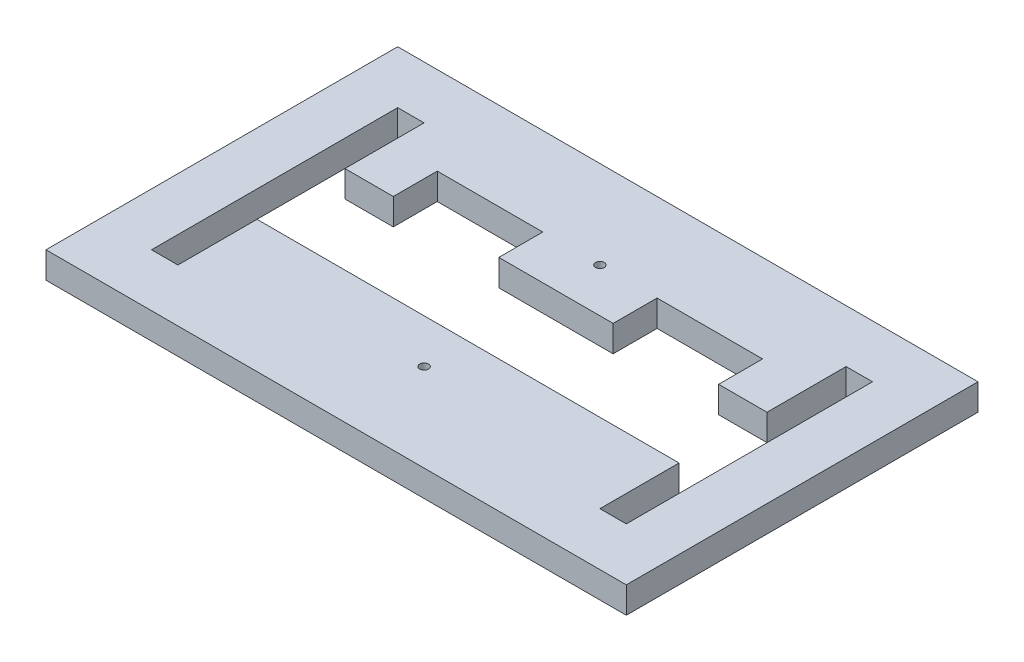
ISO-10303-21;
HEADER;
FILE_DESCRIPTION(('STEP AP214'),'2;1');
FILE_NAME('part.step','',(''),(''),'','','');
FILE_SCHEMA(('AUTOMOTIVE_DESIGN { 1 0 10303 214 1 1 1 1 }'));
ENDSEC;
DATA;
#1=APPLICATION_CONTEXT('core data for automotive mechanical design processes');
#2=APPLICATION_PROTOCOL_DEFINITION('international standard','automotive_design',2000,#1);
#3=PRODUCT_CONTEXT('',#1,'mechanical');
#4=PRODUCT('Part','Part','',(#3));
#5=PRODUCT_RELATED_PRODUCT_CATEGORY('part','',(#4));
#6=PRODUCT_DEFINITION_FORMATION('','',#4);
#7=PRODUCT_DEFINITION_CONTEXT('part definition',#1,'design');
#8=PRODUCT_DEFINITION('design','',#6,#7);
#9=PRODUCT_DEFINITION_SHAPE('','',#8);
#10=(LENGTH_UNIT() NAMED_UNIT(*) SI_UNIT(.MILLI.,.METRE.));
#11=(NAMED_UNIT(*) PLANE_ANGLE_UNIT() SI_UNIT($,.RADIAN.));
#12=(NAMED_UNIT(*) SI_UNIT($,.STERADIAN.) SOLID_ANGLE_UNIT());
#13=UNCERTAINTY_MEASURE_WITH_UNIT(LENGTH_MEASURE(1.E-05),#10,'distance_accuracy_value','');
#14=(GEOMETRIC_REPRESENTATION_CONTEXT(3) GLOBAL_UNCERTAINTY_ASSIGNED_CONTEXT((#13)) GLOBAL_UNIT_ASSIGNED_CONTEXT((#10,
#11,#12)) REPRESENTATION_CONTEXT('',''));
#15=CARTESIAN_POINT('',(0.,0.,0.));
#16=DIRECTION('',(0.,0.,1.));
#17=DIRECTION('',(1.,0.,0.));
#18=AXIS2_PLACEMENT_3D('',#15,#16,#17);
#19=CARTESIAN_POINT('',(33.,3.,20.));
#20=DIRECTION('',(0.,1.,0.));
#21=DIRECTION('',(0.,0.,1.));
#22=AXIS2_PLACEMENT_3D('',#19,#20,#21);
#23=PLANE('',#22);
#24=CARTESIAN_POINT('',(0.,3.,-10.));
#25=DIRECTION('',(0.,1.,0.));
#26=DIRECTION('',(0.,0.,1.));
#27=AXIS2_PLACEMENT_3D('',#24,#25,#26);
#28=CIRCLE('',#27,0.5);
#29=CARTESIAN_POINT('',(0.,3.,-9.5));
#30=VERTEX_POINT('',#29);
#31=EDGE_CURVE('E223',#30,#30,#28,.F.);
#32=ORIENTED_EDGE('',*,*,#31,.T.);
#33=EDGE_LOOP('',(#32));
#34=FACE_BOUND('',#33,.T.);
#35=DIRECTION('',(0.,0.,-1.));
#36=VECTOR('',#35,1.);
#37=CARTESIAN_POINT('',(33.,3.,-20.));
#38=LINE('',#37,#36);
#39=CARTESIAN_POINT('',(33.,3.,20.));
#40=VERTEX_POINT('',#39);
#41=CARTESIAN_POINT('',(33.,3.,-20.));
#42=VERTEX_POINT('',#41);
#43=EDGE_CURVE('E305',#40,#42,#38,.T.);
#44=ORIENTED_EDGE('',*,*,#43,.T.);
#45=DIRECTION('',(-1.,0.,0.));
#46=VECTOR('',#45,1.);
#47=CARTESIAN_POINT('',(-33.,3.,-20.));
#48=LINE('',#47,#46);
#49=CARTESIAN_POINT('',(-33.,3.,-20.));
#50=VERTEX_POINT('',#49);
#51=EDGE_CURVE('E317',#42,#50,#48,.T.);
#52=ORIENTED_EDGE('',*,*,#51,.T.);
#53=DIRECTION('',(0.,0.,1.));
#54=VECTOR('',#53,1.);
#55=CARTESIAN_POINT('',(-33.,3.,-20.));
#56=LINE('',#55,#54);
#57=CARTESIAN_POINT('',(-33.,3.,20.));
#58=VERTEX_POINT('',#57);
#59=EDGE_CURVE('E315',#50,#58,#56,.T.);
#60=ORIENTED_EDGE('',*,*,#59,.T.);
#61=DIRECTION('',(1.,0.,0.));
#62=VECTOR('',#61,1.);
#63=CARTESIAN_POINT('',(-33.,3.,20.));
#64=LINE('',#63,#62);
#65=EDGE_CURVE('E302',#58,#40,#64,.T.);
#66=ORIENTED_EDGE('',*,*,#65,.T.);
#67=EDGE_LOOP('',(#44,#52,#60,#66));
#68=FACE_BOUND('',#67,.T.);
#69=CARTESIAN_POINT('',(0.,3.,10.));
#70=DIRECTION('',(0.,1.,0.));
#71=DIRECTION('',(0.,0.,1.));
#72=AXIS2_PLACEMENT_3D('',#69,#70,#71);
#73=CIRCLE('',#72,0.5);
#74=CARTESIAN_POINT('',(0.,3.,10.5));
#75=VERTEX_POINT('',#74);
#76=EDGE_CURVE('E232',#75,#75,#73,.F.);
#77=ORIENTED_EDGE('',*,*,#76,.T.);
#78=EDGE_LOOP('',(#77));
#79=FACE_BOUND('',#78,.T.);
#80=DIRECTION('',(1.,0.,0.));
#81=VECTOR('',#80,1.);
#82=CARTESIAN_POINT('',(33.,3.,-10.));
#83=LINE('',#82,#81);
#84=CARTESIAN_POINT('',(6.49999999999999,3.,-10.));
#85=VERTEX_POINT('',#84);
#86=CARTESIAN_POINT('',(18.5,3.,-10.));
#87=VERTEX_POINT('',#86);
#88=EDGE_CURVE('E260',#85,#87,#83,.T.);
#89=ORIENTED_EDGE('',*,*,#88,.T.);
#90=DIRECTION('',(0.,0.,1.));
#91=VECTOR('',#90,1.);
#92=CARTESIAN_POINT('',(18.5,3.,20.));
#93=LINE('',#92,#91);
#94=CARTESIAN_POINT('',(18.5,3.,-5.));
#95=VERTEX_POINT('',#94);
#96=EDGE_CURVE('E263',#87,#95,#93,.T.);
#97=ORIENTED_EDGE('',*,*,#96,.T.);
#98=DIRECTION('',(1.,0.,0.));
#99=VECTOR('',#98,1.);
#100=CARTESIAN_POINT('',(33.,3.,-5.));
#101=LINE('',#100,#99);
#102=CARTESIAN_POINT('',(24.,3.,-5.));
#103=VERTEX_POINT('',#102);
#104=EDGE_CURVE('E211',#95,#103,#101,.T.);
#105=ORIENTED_EDGE('',*,*,#104,.T.);
#106=DIRECTION('',(0.,0.,1.));
#107=VECTOR('',#106,1.);
#108=CARTESIAN_POINT('',(24.,3.,14.));
#109=LINE('',#108,#107);
#110=CARTESIAN_POINT('',(24.,3.,-14.));
#111=VERTEX_POINT('',#110);
#112=EDGE_CURVE('E379',#111,#103,#109,.T.);
#113=ORIENTED_EDGE('',*,*,#112,.F.);
#114=DIRECTION('',(-1.,0.,0.));
#115=VECTOR('',#114,1.);
#116=CARTESIAN_POINT('',(24.,3.,-14.));
#117=LINE('',#116,#115);
#118=CARTESIAN_POINT('',(27.,3.,-14.));
#119=VERTEX_POINT('',#118);
#120=EDGE_CURVE('E356',#119,#111,#117,.T.);
#121=ORIENTED_EDGE('',*,*,#120,.F.);
#122=DIRECTION('',(0.,0.,-1.));
#123=VECTOR('',#122,1.);
#124=CARTESIAN_POINT('',(27.,3.,14.));
#125=LINE('',#124,#123);
#126=CARTESIAN_POINT('',(27.,3.,14.));
#127=VERTEX_POINT('',#126);
#128=EDGE_CURVE('E386',#127,#119,#125,.T.);
#129=ORIENTED_EDGE('',*,*,#128,.F.);
#130=DIRECTION('',(1.,0.,0.));
#131=VECTOR('',#130,1.);
#132=CARTESIAN_POINT('',(24.,3.,14.));
#133=LINE('',#132,#131);
#134=CARTESIAN_POINT('',(24.,3.,14.));
#135=VERTEX_POINT('',#134);
#136=EDGE_CURVE('E383',#135,#127,#133,.T.);
#137=ORIENTED_EDGE('',*,*,#136,.F.);
#138=CARTESIAN_POINT('',(24.,3.,5.));
#139=VERTEX_POINT('',#138);
#140=EDGE_CURVE('E382',#139,#135,#109,.T.);
#141=ORIENTED_EDGE('',*,*,#140,.F.);
#142=DIRECTION('',(-1.,0.,0.));
#143=VECTOR('',#142,1.);
#144=CARTESIAN_POINT('',(33.,3.,5.));
#145=LINE('',#144,#143);
#146=CARTESIAN_POINT('',(-24.,3.,5.));
#147=VERTEX_POINT('',#146);
#148=EDGE_CURVE('E392',#139,#147,#145,.T.);
#149=ORIENTED_EDGE('',*,*,#148,.T.);
#150=DIRECTION('',(0.,0.,-1.));
#151=VECTOR('',#150,1.);
#152=CARTESIAN_POINT('',(-24.,3.,14.));
#153=LINE('',#152,#151);
#154=CARTESIAN_POINT('',(-24.,3.,14.));
#155=VERTEX_POINT('',#154);
#156=EDGE_CURVE('E352',#155,#147,#153,.T.);
#157=ORIENTED_EDGE('',*,*,#156,.F.);
#158=DIRECTION('',(1.,0.,0.));
#159=VECTOR('',#158,1.);
#160=CARTESIAN_POINT('',(-24.,3.,14.));
#161=LINE('',#160,#159);
#162=CARTESIAN_POINT('',(-27.,3.,14.));
#163=VERTEX_POINT('',#162);
#164=EDGE_CURVE('E349',#163,#155,#161,.T.);
#165=ORIENTED_EDGE('',*,*,#164,.F.);
#166=DIRECTION('',(0.,0.,1.));
#167=VECTOR('',#166,1.);
#168=CARTESIAN_POINT('',(-27.,3.,14.));
#169=LINE('',#168,#167);
#170=CARTESIAN_POINT('',(-27.,3.,-14.));
#171=VERTEX_POINT('',#170);
#172=EDGE_CURVE('E346',#171,#163,#169,.T.);
#173=ORIENTED_EDGE('',*,*,#172,.F.);
#174=DIRECTION('',(-1.,0.,0.));
#175=VECTOR('',#174,1.);
#176=CARTESIAN_POINT('',(-24.,3.,-14.));
#177=LINE('',#176,#175);
#178=CARTESIAN_POINT('',(-24.,3.,-14.));
#179=VERTEX_POINT('',#178);
#180=EDGE_CURVE('E313',#179,#171,#177,.T.);
#181=ORIENTED_EDGE('',*,*,#180,.F.);
#182=CARTESIAN_POINT('',(-24.,3.,-5.));
#183=VERTEX_POINT('',#182);
#184=EDGE_CURVE('E355',#183,#179,#153,.T.);
#185=ORIENTED_EDGE('',*,*,#184,.F.);
#186=CARTESIAN_POINT('',(-18.5,3.,-5.));
#187=VERTEX_POINT('',#186);
#188=EDGE_CURVE('E388',#183,#187,#101,.T.);
#189=ORIENTED_EDGE('',*,*,#188,.T.);
#190=DIRECTION('',(0.,0.,-1.));
#191=VECTOR('',#190,1.);
#192=CARTESIAN_POINT('',(-18.5,3.,20.));
#193=LINE('',#192,#191);
#194=CARTESIAN_POINT('',(-18.5,3.,-10.));
#195=VERTEX_POINT('',#194);
#196=EDGE_CURVE('E243',#187,#195,#193,.T.);
#197=ORIENTED_EDGE('',*,*,#196,.T.);
#198=DIRECTION('',(1.,0.,0.));
#199=VECTOR('',#198,1.);
#200=CARTESIAN_POINT('',(33.,3.,-9.99999999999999));
#201=LINE('',#200,#199);
#202=CARTESIAN_POINT('',(-6.49999999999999,3.,-10.));
#203=VERTEX_POINT('',#202);
#204=EDGE_CURVE('E240',#195,#203,#201,.T.);
#205=ORIENTED_EDGE('',*,*,#204,.T.);
#206=DIRECTION('',(0.,0.,1.));
#207=VECTOR('',#206,1.);
#208=CARTESIAN_POINT('',(-6.50000000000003,3.,19.9999999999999));
#209=LINE('',#208,#207);
#210=CARTESIAN_POINT('',(-6.5,3.,-5.));
#211=VERTEX_POINT('',#210);
#212=EDGE_CURVE('E246',#203,#211,#209,.T.);
#213=ORIENTED_EDGE('',*,*,#212,.T.);
#214=CARTESIAN_POINT('',(6.5,3.,-5.));
#215=VERTEX_POINT('',#214);
#216=EDGE_CURVE('E391',#211,#215,#101,.T.);
#217=ORIENTED_EDGE('',*,*,#216,.T.);
#218=DIRECTION('',(0.,0.,-1.));
#219=VECTOR('',#218,1.);
#220=CARTESIAN_POINT('',(6.50000000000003,3.,20.));
#221=LINE('',#220,#219);
#222=EDGE_CURVE('E47',#215,#85,#221,.T.);
#223=ORIENTED_EDGE('',*,*,#222,.T.);
#224=EDGE_LOOP('',(#89,#97,#105,#113,#121,#129,#137,#141,#149,#157,#165,#173,#181,#185,#189,
#197,#205,#213,#217,#223));
#225=FACE_BOUND('',#224,.T.);
#226=ADVANCED_FACE('F32',(#34,#68,#79,#225),#23,.T.);
#227=CARTESIAN_POINT('',(33.,0.,20.));
#228=DIRECTION('',(0.,1.,0.));
#229=DIRECTION('',(0.,0.,1.));
#230=AXIS2_PLACEMENT_3D('',#227,#228,#229);
#231=PLANE('',#230);
#232=CARTESIAN_POINT('',(0.,0.,-10.));
#233=DIRECTION('',(0.,1.,0.));
#234=DIRECTION('',(0.,0.,1.));
#235=AXIS2_PLACEMENT_3D('',#232,#233,#234);
#236=CIRCLE('',#235,0.5);
#237=CARTESIAN_POINT('',(0.,0.,-9.5));
#238=VERTEX_POINT('',#237);
#239=EDGE_CURVE('E228',#238,#238,#236,.T.);
#240=ORIENTED_EDGE('',*,*,#239,.T.);
#241=EDGE_LOOP('',(#240));
#242=FACE_BOUND('',#241,.T.);
#243=DIRECTION('',(0.,0.,-1.));
#244=VECTOR('',#243,1.);
#245=CARTESIAN_POINT('',(33.,0.,-20.));
#246=LINE('',#245,#244);
#247=CARTESIAN_POINT('',(33.,0.,20.));
#248=VERTEX_POINT('',#247);
#249=CARTESIAN_POINT('',(33.,0.,-20.));
#250=VERTEX_POINT('',#249);
#251=EDGE_CURVE('E310',#248,#250,#246,.T.);
#252=ORIENTED_EDGE('',*,*,#251,.F.);
#253=DIRECTION('',(1.,0.,0.));
#254=VECTOR('',#253,1.);
#255=CARTESIAN_POINT('',(-33.,0.,20.));
#256=LINE('',#255,#254);
#257=CARTESIAN_POINT('',(-33.,0.,20.));
#258=VERTEX_POINT('',#257);
#259=EDGE_CURVE('E303',#258,#248,#256,.T.);
#260=ORIENTED_EDGE('',*,*,#259,.F.);
#261=DIRECTION('',(0.,0.,1.));
#262=VECTOR('',#261,1.);
#263=CARTESIAN_POINT('',(-33.,0.,-20.));
#264=LINE('',#263,#262);
#265=CARTESIAN_POINT('',(-33.,0.,-20.));
#266=VERTEX_POINT('',#265);
#267=EDGE_CURVE('E306',#266,#258,#264,.T.);
#268=ORIENTED_EDGE('',*,*,#267,.F.);
#269=DIRECTION('',(-1.,0.,0.));
#270=VECTOR('',#269,1.);
#271=CARTESIAN_POINT('',(-33.,0.,-20.));
#272=LINE('',#271,#270);
#273=EDGE_CURVE('E308',#250,#266,#272,.T.);
#274=ORIENTED_EDGE('',*,*,#273,.F.);
#275=EDGE_LOOP('',(#252,#260,#268,#274));
#276=FACE_BOUND('',#275,.T.);
#277=CARTESIAN_POINT('',(0.,0.,10.));
#278=DIRECTION('',(0.,1.,0.));
#279=DIRECTION('',(0.,0.,-1.));
#280=AXIS2_PLACEMENT_3D('',#277,#278,#279);
#281=CIRCLE('',#280,0.5);
#282=CARTESIAN_POINT('',(0.,0.,9.5));
#283=VERTEX_POINT('',#282);
#284=EDGE_CURVE('E237',#283,#283,#281,.T.);
#285=ORIENTED_EDGE('',*,*,#284,.T.);
#286=EDGE_LOOP('',(#285));
#287=FACE_BOUND('',#286,.T.);
#288=DIRECTION('',(0.,0.,-1.));
#289=VECTOR('',#288,1.);
#290=CARTESIAN_POINT('',(18.5,0.,-5.));
#291=LINE('',#290,#289);
#292=CARTESIAN_POINT('',(18.5,0.,-5.));
#293=VERTEX_POINT('',#292);
#294=CARTESIAN_POINT('',(18.5,0.,-10.));
#295=VERTEX_POINT('',#294);
#296=EDGE_CURVE('E195',#293,#295,#291,.T.);
#297=ORIENTED_EDGE('',*,*,#296,.T.);
#298=DIRECTION('',(-1.,0.,0.));
#299=VECTOR('',#298,1.);
#300=CARTESIAN_POINT('',(18.5,0.,-10.));
#301=LINE('',#300,#299);
#302=CARTESIAN_POINT('',(6.49999999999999,0.,-10.));
#303=VERTEX_POINT('',#302);
#304=EDGE_CURVE('E203',#295,#303,#301,.T.);
#305=ORIENTED_EDGE('',*,*,#304,.T.);
#306=DIRECTION('',(0.,0.,1.));
#307=VECTOR('',#306,1.);
#308=CARTESIAN_POINT('',(6.5,0.,-5.));
#309=LINE('',#308,#307);
#310=CARTESIAN_POINT('',(6.5,0.,-5.));
#311=VERTEX_POINT('',#310);
#312=EDGE_CURVE('E269',#303,#311,#309,.T.);
#313=ORIENTED_EDGE('',*,*,#312,.T.);
#314=DIRECTION('',(-1.,0.,0.));
#315=VECTOR('',#314,1.);
#316=CARTESIAN_POINT('',(-24.,0.,-5.));
#317=LINE('',#316,#315);
#318=CARTESIAN_POINT('',(-6.49999999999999,0.,-5.));
#319=VERTEX_POINT('',#318);
#320=EDGE_CURVE('E55',#311,#319,#317,.T.);
#321=ORIENTED_EDGE('',*,*,#320,.T.);
#322=DIRECTION('',(0.,0.,-1.));
#323=VECTOR('',#322,1.);
#324=CARTESIAN_POINT('',(-6.5,0.,-5.));
#325=LINE('',#324,#323);
#326=CARTESIAN_POINT('',(-6.49999999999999,0.,-10.));
#327=VERTEX_POINT('',#326);
#328=EDGE_CURVE('E256',#319,#327,#325,.T.);
#329=ORIENTED_EDGE('',*,*,#328,.T.);
#330=DIRECTION('',(-1.,0.,0.));
#331=VECTOR('',#330,1.);
#332=CARTESIAN_POINT('',(-18.5,0.,-10.));
#333=LINE('',#332,#331);
#334=CARTESIAN_POINT('',(-18.5,0.,-10.));
#335=VERTEX_POINT('',#334);
#336=EDGE_CURVE('E253',#327,#335,#333,.T.);
#337=ORIENTED_EDGE('',*,*,#336,.T.);
#338=DIRECTION('',(0.,0.,1.));
#339=VECTOR('',#338,1.);
#340=CARTESIAN_POINT('',(-18.5,0.,-5.));
#341=LINE('',#340,#339);
#342=CARTESIAN_POINT('',(-18.5,0.,-5.));
#343=VERTEX_POINT('',#342);
#344=EDGE_CURVE('E258',#335,#343,#341,.T.);
#345=ORIENTED_EDGE('',*,*,#344,.T.);
#346=CARTESIAN_POINT('',(-24.,0.,-5.));
#347=VERTEX_POINT('',#346);
#348=EDGE_CURVE('E218',#343,#347,#317,.T.);
#349=ORIENTED_EDGE('',*,*,#348,.T.);
#350=DIRECTION('',(0.,0.,-1.));
#351=VECTOR('',#350,1.);
#352=CARTESIAN_POINT('',(-24.,0.,14.));
#353=LINE('',#352,#351);
#354=CARTESIAN_POINT('',(-24.,0.,-14.));
#355=VERTEX_POINT('',#354);
#356=EDGE_CURVE('E339',#347,#355,#353,.T.);
#357=ORIENTED_EDGE('',*,*,#356,.T.);
#358=DIRECTION('',(-1.,0.,0.));
#359=VECTOR('',#358,1.);
#360=CARTESIAN_POINT('',(-24.,0.,-14.));
#361=LINE('',#360,#359);
#362=CARTESIAN_POINT('',(-27.,0.,-14.));
#363=VERTEX_POINT('',#362);
#364=EDGE_CURVE('E333',#355,#363,#361,.T.);
#365=ORIENTED_EDGE('',*,*,#364,.T.);
#366=DIRECTION('',(0.,0.,1.));
#367=VECTOR('',#366,1.);
#368=CARTESIAN_POINT('',(-27.,0.,14.));
#369=LINE('',#368,#367);
#370=CARTESIAN_POINT('',(-27.,0.,14.));
#371=VERTEX_POINT('',#370);
#372=EDGE_CURVE('E343',#363,#371,#369,.T.);
#373=ORIENTED_EDGE('',*,*,#372,.T.);
#374=DIRECTION('',(1.,0.,0.));
#375=VECTOR('',#374,1.);
#376=CARTESIAN_POINT('',(-24.,0.,14.));
#377=LINE('',#376,#375);
#378=CARTESIAN_POINT('',(-24.,0.,14.));
#379=VERTEX_POINT('',#378);
#380=EDGE_CURVE('E340',#371,#379,#377,.T.);
#381=ORIENTED_EDGE('',*,*,#380,.T.);
#382=CARTESIAN_POINT('',(-24.,0.,5.));
#383=VERTEX_POINT('',#382);
#384=EDGE_CURVE('E336',#379,#383,#353,.T.);
#385=ORIENTED_EDGE('',*,*,#384,.T.);
#386=DIRECTION('',(1.,0.,0.));
#387=VECTOR('',#386,1.);
#388=CARTESIAN_POINT('',(-24.,0.,5.));
#389=LINE('',#388,#387);
#390=CARTESIAN_POINT('',(24.,0.,5.));
#391=VERTEX_POINT('',#390);
#392=EDGE_CURVE('E216',#383,#391,#389,.T.);
#393=ORIENTED_EDGE('',*,*,#392,.T.);
#394=DIRECTION('',(0.,0.,1.));
#395=VECTOR('',#394,1.);
#396=CARTESIAN_POINT('',(24.,0.,14.));
#397=LINE('',#396,#395);
#398=CARTESIAN_POINT('',(24.,0.,14.));
#399=VERTEX_POINT('',#398);
#400=EDGE_CURVE('E378',#391,#399,#397,.T.);
#401=ORIENTED_EDGE('',*,*,#400,.T.);
#402=DIRECTION('',(1.,0.,0.));
#403=VECTOR('',#402,1.);
#404=CARTESIAN_POINT('',(24.,0.,14.));
#405=LINE('',#404,#403);
#406=CARTESIAN_POINT('',(27.,0.,14.));
#407=VERTEX_POINT('',#406);
#408=EDGE_CURVE('E374',#399,#407,#405,.T.);
#409=ORIENTED_EDGE('',*,*,#408,.T.);
#410=DIRECTION('',(0.,0.,-1.));
#411=VECTOR('',#410,1.);
#412=CARTESIAN_POINT('',(27.,0.,14.));
#413=LINE('',#412,#411);
#414=CARTESIAN_POINT('',(27.,0.,-14.));
#415=VERTEX_POINT('',#414);
#416=EDGE_CURVE('E371',#407,#415,#413,.T.);
#417=ORIENTED_EDGE('',*,*,#416,.T.);
#418=DIRECTION('',(-1.,0.,0.));
#419=VECTOR('',#418,1.);
#420=CARTESIAN_POINT('',(24.,0.,-14.));
#421=LINE('',#420,#419);
#422=CARTESIAN_POINT('',(24.,0.,-14.));
#423=VERTEX_POINT('',#422);
#424=EDGE_CURVE('E369',#415,#423,#421,.T.);
#425=ORIENTED_EDGE('',*,*,#424,.T.);
#426=CARTESIAN_POINT('',(24.,0.,-5.));
#427=VERTEX_POINT('',#426);
#428=EDGE_CURVE('E215',#423,#427,#397,.T.);
#429=ORIENTED_EDGE('',*,*,#428,.T.);
#430=EDGE_CURVE('E209',#427,#293,#317,.T.);
#431=ORIENTED_EDGE('',*,*,#430,.T.);
#432=EDGE_LOOP('',(#297,#305,#313,#321,#329,#337,#345,#349,#357,#365,#373,#381,#385,#393,#401,
#409,#417,#425,#429,#431));
#433=FACE_BOUND('',#432,.T.);
#434=ADVANCED_FACE('F213',(#242,#276,#287,#433),#231,.F.);
#435=CARTESIAN_POINT('',(-24.,10.,-5.));
#436=DIRECTION('',(0.,0.,1.));
#437=DIRECTION('',(1.,0.,0.));
#438=AXIS2_PLACEMENT_3D('',#435,#436,#437);
#439=PLANE('',#438);
#440=ORIENTED_EDGE('',*,*,#104,.F.);
#441=DIRECTION('',(0.,-1.,0.));
#442=VECTOR('',#441,1.);
#443=CARTESIAN_POINT('',(18.5,10.,-5.));
#444=LINE('',#443,#442);
#445=EDGE_CURVE('E11',#95,#293,#444,.T.);
#446=ORIENTED_EDGE('',*,*,#445,.T.);
#447=ORIENTED_EDGE('',*,*,#430,.F.);
#448=DIRECTION('',(0.,-1.,0.));
#449=VECTOR('',#448,1.);
#450=CARTESIAN_POINT('',(24.,3.001,-5.));
#451=LINE('',#450,#449);
#452=EDGE_CURVE('E285',#103,#427,#451,.T.);
#453=ORIENTED_EDGE('',*,*,#452,.F.);
#454=EDGE_LOOP('',(#440,#446,#447,#453));
#455=FACE_BOUND('',#454,.T.);
#456=ADVANCED_FACE('F207',(#455),#439,.T.);
#457=ORIENTED_EDGE('',*,*,#320,.F.);
#458=DIRECTION('',(0.,1.,0.));
#459=VECTOR('',#458,1.);
#460=CARTESIAN_POINT('',(6.5,10.,-5.));
#461=LINE('',#460,#459);
#462=EDGE_CURVE('E40',#311,#215,#461,.T.);
#463=ORIENTED_EDGE('',*,*,#462,.T.);
#464=ORIENTED_EDGE('',*,*,#216,.F.);
#465=DIRECTION('',(0.,-1.,0.));
#466=VECTOR('',#465,1.);
#467=CARTESIAN_POINT('',(-6.5,10.,-5.));
#468=LINE('',#467,#466);
#469=EDGE_CURVE('E280',#211,#319,#468,.T.);
#470=ORIENTED_EDGE('',*,*,#469,.T.);
#471=EDGE_LOOP('',(#457,#463,#464,#470));
#472=FACE_BOUND('',#471,.T.);
#473=ADVANCED_FACE('F431',(#472),#439,.T.);
#474=ORIENTED_EDGE('',*,*,#348,.F.);
#475=DIRECTION('',(0.,1.,0.));
#476=VECTOR('',#475,1.);
#477=CARTESIAN_POINT('',(-18.5,10.,-5.));
#478=LINE('',#477,#476);
#479=EDGE_CURVE('E278',#343,#187,#478,.T.);
#480=ORIENTED_EDGE('',*,*,#479,.T.);
#481=ORIENTED_EDGE('',*,*,#188,.F.);
#482=DIRECTION('',(0.,-1.,0.));
#483=VECTOR('',#482,1.);
#484=CARTESIAN_POINT('',(-24.,10.,-5.));
#485=LINE('',#484,#483);
#486=EDGE_CURVE('E395',#183,#347,#485,.T.);
#487=ORIENTED_EDGE('',*,*,#486,.T.);
#488=EDGE_LOOP('',(#474,#480,#481,#487));
#489=FACE_BOUND('',#488,.T.);
#490=ADVANCED_FACE('F443',(#489),#439,.T.);
#491=CARTESIAN_POINT('',(-24.,3.001,14.));
#492=DIRECTION('',(-1.,0.,0.));
#493=DIRECTION('',(0.,0.,1.));
#494=AXIS2_PLACEMENT_3D('',#491,#492,#493);
#495=PLANE('',#494);
#496=ORIENTED_EDGE('',*,*,#356,.F.);
#497=ORIENTED_EDGE('',*,*,#486,.F.);
#498=ORIENTED_EDGE('',*,*,#184,.T.);
#499=DIRECTION('',(0.,-1.,0.));
#500=VECTOR('',#499,1.);
#501=CARTESIAN_POINT('',(-24.,3.001,-14.));
#502=LINE('',#501,#500);
#503=EDGE_CURVE('E327',#179,#355,#502,.T.);
#504=ORIENTED_EDGE('',*,*,#503,.T.);
#505=EDGE_LOOP('',(#496,#497,#498,#504));
#506=FACE_BOUND('',#505,.T.);
#507=ADVANCED_FACE('F450',(#506),#495,.T.);
#508=ORIENTED_EDGE('',*,*,#156,.T.);
#509=DIRECTION('',(0.,-1.,0.));
#510=VECTOR('',#509,1.);
#511=CARTESIAN_POINT('',(-24.,10.,5.));
#512=LINE('',#511,#510);
#513=EDGE_CURVE('E220',#147,#383,#512,.T.);
#514=ORIENTED_EDGE('',*,*,#513,.T.);
#515=ORIENTED_EDGE('',*,*,#384,.F.);
#516=DIRECTION('',(0.,-1.,0.));
#517=VECTOR('',#516,1.);
#518=CARTESIAN_POINT('',(-24.,3.001,14.));
#519=LINE('',#518,#517);
#520=EDGE_CURVE('E325',#155,#379,#519,.T.);
#521=ORIENTED_EDGE('',*,*,#520,.F.);
#522=EDGE_LOOP('',(#508,#514,#515,#521));
#523=FACE_BOUND('',#522,.T.);
#524=ADVANCED_FACE('F400',(#523),#495,.T.);
#525=CARTESIAN_POINT('',(24.,3.001,14.));
#526=DIRECTION('',(1.,0.,0.));
#527=DIRECTION('',(0.,0.,-1.));
#528=AXIS2_PLACEMENT_3D('',#525,#526,#527);
#529=PLANE('',#528);
#530=ORIENTED_EDGE('',*,*,#112,.T.);
#531=ORIENTED_EDGE('',*,*,#452,.T.);
#532=ORIENTED_EDGE('',*,*,#428,.F.);
#533=DIRECTION('',(0.,-1.,0.));
#534=VECTOR('',#533,1.);
#535=CARTESIAN_POINT('',(24.,3.001,-14.));
#536=LINE('',#535,#534);
#537=EDGE_CURVE('E366',#111,#423,#536,.T.);
#538=ORIENTED_EDGE('',*,*,#537,.F.);
#539=EDGE_LOOP('',(#530,#531,#532,#538));
#540=FACE_BOUND('',#539,.T.);
#541=ADVANCED_FACE('F430',(#540),#529,.T.);
#542=ORIENTED_EDGE('',*,*,#400,.F.);
#543=DIRECTION('',(0.,1.,0.));
#544=VECTOR('',#543,1.);
#545=CARTESIAN_POINT('',(24.,3.001,5.));
#546=LINE('',#545,#544);
#547=EDGE_CURVE('E287',#391,#139,#546,.T.);
#548=ORIENTED_EDGE('',*,*,#547,.T.);
#549=ORIENTED_EDGE('',*,*,#140,.T.);
#550=DIRECTION('',(0.,-1.,0.));
#551=VECTOR('',#550,1.);
#552=CARTESIAN_POINT('',(24.,3.001,14.));
#553=LINE('',#552,#551);
#554=EDGE_CURVE('E359',#135,#399,#553,.T.);
#555=ORIENTED_EDGE('',*,*,#554,.T.);
#556=EDGE_LOOP('',(#542,#548,#549,#555));
#557=FACE_BOUND('',#556,.T.);
#558=ADVANCED_FACE('F414',(#557),#529,.T.);
#559=CARTESIAN_POINT('',(33.,3.,-20.));
#560=DIRECTION('',(-1.,0.,0.));
#561=DIRECTION('',(0.,0.,1.));
#562=AXIS2_PLACEMENT_3D('',#559,#560,#561);
#563=PLANE('',#562);
#564=ORIENTED_EDGE('',*,*,#251,.T.);
#565=DIRECTION('',(0.,-1.,0.));
#566=VECTOR('',#565,1.);
#567=CARTESIAN_POINT('',(33.,3.,-20.));
#568=LINE('',#567,#566);
#569=EDGE_CURVE('E290',#42,#250,#568,.T.);
#570=ORIENTED_EDGE('',*,*,#569,.F.);
#571=ORIENTED_EDGE('',*,*,#43,.F.);
#572=DIRECTION('',(0.,-1.,0.));
#573=VECTOR('',#572,1.);
#574=CARTESIAN_POINT('',(33.,3.,20.));
#575=LINE('',#574,#573);
#576=EDGE_CURVE('E299',#40,#248,#575,.T.);
#577=ORIENTED_EDGE('',*,*,#576,.T.);
#578=EDGE_LOOP('',(#564,#570,#571,#577));
#579=FACE_BOUND('',#578,.T.);
#580=ADVANCED_FACE('F34',(#579),#563,.F.);
#581=CARTESIAN_POINT('',(-33.,3.,-20.));
#582=DIRECTION('',(0.,0.,1.));
#583=DIRECTION('',(1.,0.,0.));
#584=AXIS2_PLACEMENT_3D('',#581,#582,#583);
#585=PLANE('',#584);
#586=ORIENTED_EDGE('',*,*,#273,.T.);
#587=DIRECTION('',(0.,-1.,0.));
#588=VECTOR('',#587,1.);
#589=CARTESIAN_POINT('',(-33.,3.,-20.));
#590=LINE('',#589,#588);
#591=EDGE_CURVE('E293',#50,#266,#590,.T.);
#592=ORIENTED_EDGE('',*,*,#591,.F.);
#593=ORIENTED_EDGE('',*,*,#51,.F.);
#594=ORIENTED_EDGE('',*,*,#569,.T.);
#595=EDGE_LOOP('',(#586,#592,#593,#594));
#596=FACE_BOUND('',#595,.T.);
#597=ADVANCED_FACE('F477',(#596),#585,.F.);
#598=CARTESIAN_POINT('',(-33.,3.,-20.));
#599=DIRECTION('',(1.,0.,0.));
#600=DIRECTION('',(0.,0.,-1.));
#601=AXIS2_PLACEMENT_3D('',#598,#599,#600);
#602=PLANE('',#601);
#603=ORIENTED_EDGE('',*,*,#267,.T.);
#604=DIRECTION('',(0.,-1.,0.));
#605=VECTOR('',#604,1.);
#606=CARTESIAN_POINT('',(-33.,3.,20.));
#607=LINE('',#606,#605);
#608=EDGE_CURVE('E296',#58,#258,#607,.T.);
#609=ORIENTED_EDGE('',*,*,#608,.F.);
#610=ORIENTED_EDGE('',*,*,#59,.F.);
#611=ORIENTED_EDGE('',*,*,#591,.T.);
#612=EDGE_LOOP('',(#603,#609,#610,#611));
#613=FACE_BOUND('',#612,.T.);
#614=ADVANCED_FACE('F464',(#613),#602,.F.);
#615=CARTESIAN_POINT('',(-33.,3.,20.));
#616=DIRECTION('',(0.,0.,-1.));
#617=DIRECTION('',(-1.,0.,0.));
#618=AXIS2_PLACEMENT_3D('',#615,#616,#617);
#619=PLANE('',#618);
#620=ORIENTED_EDGE('',*,*,#259,.T.);
#621=ORIENTED_EDGE('',*,*,#576,.F.);
#622=ORIENTED_EDGE('',*,*,#65,.F.);
#623=ORIENTED_EDGE('',*,*,#608,.T.);
#624=EDGE_LOOP('',(#620,#621,#622,#623));
#625=FACE_BOUND('',#624,.T.);
#626=ADVANCED_FACE('F457',(#625),#619,.F.);
#627=CARTESIAN_POINT('',(-27.,3.001,14.));
#628=DIRECTION('',(1.,0.,0.));
#629=DIRECTION('',(0.,0.,-1.));
#630=AXIS2_PLACEMENT_3D('',#627,#628,#629);
#631=PLANE('',#630);
#632=ORIENTED_EDGE('',*,*,#172,.T.);
#633=DIRECTION('',(0.,-1.,0.));
#634=VECTOR('',#633,1.);
#635=CARTESIAN_POINT('',(-27.,3.001,14.));
#636=LINE('',#635,#634);
#637=EDGE_CURVE('E323',#163,#371,#636,.T.);
#638=ORIENTED_EDGE('',*,*,#637,.T.);
#639=ORIENTED_EDGE('',*,*,#372,.F.);
#640=DIRECTION('',(0.,-1.,0.));
#641=VECTOR('',#640,1.);
#642=CARTESIAN_POINT('',(-27.,3.001,-14.));
#643=LINE('',#642,#641);
#644=EDGE_CURVE('E330',#171,#363,#643,.T.);
#645=ORIENTED_EDGE('',*,*,#644,.F.);
#646=EDGE_LOOP('',(#632,#638,#639,#645));
#647=FACE_BOUND('',#646,.T.);
#648=ADVANCED_FACE('F455',(#647),#631,.T.);
#649=CARTESIAN_POINT('',(-24.,3.001,14.));
#650=DIRECTION('',(0.,0.,-1.));
#651=DIRECTION('',(-1.,0.,0.));
#652=AXIS2_PLACEMENT_3D('',#649,#650,#651);
#653=PLANE('',#652);
#654=ORIENTED_EDGE('',*,*,#164,.T.);
#655=ORIENTED_EDGE('',*,*,#520,.T.);
#656=ORIENTED_EDGE('',*,*,#380,.F.);
#657=ORIENTED_EDGE('',*,*,#637,.F.);
#658=EDGE_LOOP('',(#654,#655,#656,#657));
#659=FACE_BOUND('',#658,.T.);
#660=ADVANCED_FACE('F406',(#659),#653,.T.);
#661=CARTESIAN_POINT('',(-24.,3.001,-14.));
#662=DIRECTION('',(0.,0.,1.));
#663=DIRECTION('',(1.,0.,0.));
#664=AXIS2_PLACEMENT_3D('',#661,#662,#663);
#665=PLANE('',#664);
#666=ORIENTED_EDGE('',*,*,#180,.T.);
#667=ORIENTED_EDGE('',*,*,#644,.T.);
#668=ORIENTED_EDGE('',*,*,#364,.F.);
#669=ORIENTED_EDGE('',*,*,#503,.F.);
#670=EDGE_LOOP('',(#666,#667,#668,#669));
#671=FACE_BOUND('',#670,.T.);
#672=ADVANCED_FACE('F453',(#671),#665,.T.);
#673=CARTESIAN_POINT('',(24.,3.001,14.));
#674=DIRECTION('',(0.,0.,-1.));
#675=DIRECTION('',(-1.,0.,0.));
#676=AXIS2_PLACEMENT_3D('',#673,#674,#675);
#677=PLANE('',#676);
#678=ORIENTED_EDGE('',*,*,#136,.T.);
#679=DIRECTION('',(0.,-1.,0.));
#680=VECTOR('',#679,1.);
#681=CARTESIAN_POINT('',(27.,3.001,14.));
#682=LINE('',#681,#680);
#683=EDGE_CURVE('E362',#127,#407,#682,.T.);
#684=ORIENTED_EDGE('',*,*,#683,.T.);
#685=ORIENTED_EDGE('',*,*,#408,.F.);
#686=ORIENTED_EDGE('',*,*,#554,.F.);
#687=EDGE_LOOP('',(#678,#684,#685,#686));
#688=FACE_BOUND('',#687,.T.);
#689=ADVANCED_FACE('F419',(#688),#677,.T.);
#690=CARTESIAN_POINT('',(27.,3.001,14.));
#691=DIRECTION('',(-1.,0.,0.));
#692=DIRECTION('',(0.,0.,1.));
#693=AXIS2_PLACEMENT_3D('',#690,#691,#692);
#694=PLANE('',#693);
#695=ORIENTED_EDGE('',*,*,#128,.T.);
#696=DIRECTION('',(0.,-1.,0.));
#697=VECTOR('',#696,1.);
#698=CARTESIAN_POINT('',(27.,3.001,-14.));
#699=LINE('',#698,#697);
#700=EDGE_CURVE('E364',#119,#415,#699,.T.);
#701=ORIENTED_EDGE('',*,*,#700,.T.);
#702=ORIENTED_EDGE('',*,*,#416,.F.);
#703=ORIENTED_EDGE('',*,*,#683,.F.);
#704=EDGE_LOOP('',(#695,#701,#702,#703));
#705=FACE_BOUND('',#704,.T.);
#706=ADVANCED_FACE('F422',(#705),#694,.T.);
#707=CARTESIAN_POINT('',(24.,3.001,-14.));
#708=DIRECTION('',(0.,0.,1.));
#709=DIRECTION('',(1.,0.,0.));
#710=AXIS2_PLACEMENT_3D('',#707,#708,#709);
#711=PLANE('',#710);
#712=ORIENTED_EDGE('',*,*,#120,.T.);
#713=ORIENTED_EDGE('',*,*,#537,.T.);
#714=ORIENTED_EDGE('',*,*,#424,.F.);
#715=ORIENTED_EDGE('',*,*,#700,.F.);
#716=EDGE_LOOP('',(#712,#713,#714,#715));
#717=FACE_BOUND('',#716,.T.);
#718=ADVANCED_FACE('F427',(#717),#711,.T.);
#719=CARTESIAN_POINT('',(-24.,10.,5.));
#720=DIRECTION('',(0.,0.,-1.));
#721=DIRECTION('',(-1.,0.,0.));
#722=AXIS2_PLACEMENT_3D('',#719,#720,#721);
#723=PLANE('',#722);
#724=ORIENTED_EDGE('',*,*,#547,.F.);
#725=ORIENTED_EDGE('',*,*,#392,.F.);
#726=ORIENTED_EDGE('',*,*,#513,.F.);
#727=ORIENTED_EDGE('',*,*,#148,.F.);
#728=EDGE_LOOP('',(#724,#725,#726,#727));
#729=FACE_BOUND('',#728,.T.);
#730=ADVANCED_FACE('F412',(#729),#723,.T.);
#731=CARTESIAN_POINT('',(0.,10.,-10.));
#732=DIRECTION('',(0.,-1.,0.));
#733=DIRECTION('',(0.,0.,-1.));
#734=AXIS2_PLACEMENT_3D('',#731,#732,#733);
#735=CYLINDRICAL_SURFACE('',#734,0.5);
#736=ORIENTED_EDGE('',*,*,#31,.F.);
#737=EDGE_LOOP('',(#736));
#738=FACE_BOUND('',#737,.T.);
#739=ORIENTED_EDGE('',*,*,#239,.F.);
#740=EDGE_LOOP('',(#739));
#741=FACE_BOUND('',#740,.T.);
#742=ADVANCED_FACE('F503',(#738,#741),#735,.F.);
#743=CARTESIAN_POINT('',(0.,10.,10.));
#744=DIRECTION('',(0.,-1.,0.));
#745=DIRECTION('',(0.,0.,-1.));
#746=AXIS2_PLACEMENT_3D('',#743,#744,#745);
#747=CYLINDRICAL_SURFACE('',#746,0.5);
#748=ORIENTED_EDGE('',*,*,#76,.F.);
#749=EDGE_LOOP('',(#748));
#750=FACE_BOUND('',#749,.T.);
#751=ORIENTED_EDGE('',*,*,#284,.F.);
#752=EDGE_LOOP('',(#751));
#753=FACE_BOUND('',#752,.T.);
#754=ADVANCED_FACE('F500',(#750,#753),#747,.F.);
#755=CARTESIAN_POINT('',(-18.5,10.,-5.));
#756=DIRECTION('',(1.,0.,0.));
#757=DIRECTION('',(0.,0.,-1.));
#758=AXIS2_PLACEMENT_3D('',#755,#756,#757);
#759=PLANE('',#758);
#760=ORIENTED_EDGE('',*,*,#479,.F.);
#761=ORIENTED_EDGE('',*,*,#344,.F.);
#762=DIRECTION('',(0.,-1.,0.));
#763=VECTOR('',#762,1.);
#764=CARTESIAN_POINT('',(-18.5,10.,-10.));
#765=LINE('',#764,#763);
#766=EDGE_CURVE('E251',#195,#335,#765,.T.);
#767=ORIENTED_EDGE('',*,*,#766,.F.);
#768=ORIENTED_EDGE('',*,*,#196,.F.);
#769=EDGE_LOOP('',(#760,#761,#767,#768));
#770=FACE_BOUND('',#769,.T.);
#771=ADVANCED_FACE('F441',(#770),#759,.T.);
#772=CARTESIAN_POINT('',(-6.5,10.,-5.));
#773=DIRECTION('',(-1.,0.,0.));
#774=DIRECTION('',(0.,0.,1.));
#775=AXIS2_PLACEMENT_3D('',#772,#773,#774);
#776=PLANE('',#775);
#777=DIRECTION('',(0.,-1.,0.));
#778=VECTOR('',#777,1.);
#779=CARTESIAN_POINT('',(-6.49999999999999,10.,-10.));
#780=LINE('',#779,#778);
#781=EDGE_CURVE('E249',#203,#327,#780,.T.);
#782=ORIENTED_EDGE('',*,*,#781,.T.);
#783=ORIENTED_EDGE('',*,*,#328,.F.);
#784=ORIENTED_EDGE('',*,*,#469,.F.);
#785=ORIENTED_EDGE('',*,*,#212,.F.);
#786=EDGE_LOOP('',(#782,#783,#784,#785));
#787=FACE_BOUND('',#786,.T.);
#788=ADVANCED_FACE('F433',(#787),#776,.T.);
#789=CARTESIAN_POINT('',(-18.5,10.,-10.));
#790=DIRECTION('',(0.,0.,1.));
#791=DIRECTION('',(1.,0.,0.));
#792=AXIS2_PLACEMENT_3D('',#789,#790,#791);
#793=PLANE('',#792);
#794=ORIENTED_EDGE('',*,*,#766,.T.);
#795=ORIENTED_EDGE('',*,*,#336,.F.);
#796=ORIENTED_EDGE('',*,*,#781,.F.);
#797=ORIENTED_EDGE('',*,*,#204,.F.);
#798=EDGE_LOOP('',(#794,#795,#796,#797));
#799=FACE_BOUND('',#798,.T.);
#800=ADVANCED_FACE('F438',(#799),#793,.T.);
#801=CARTESIAN_POINT('',(18.5,10.,-5.));
#802=DIRECTION('',(-1.,0.,0.));
#803=DIRECTION('',(0.,0.,1.));
#804=AXIS2_PLACEMENT_3D('',#801,#802,#803);
#805=PLANE('',#804);
#806=DIRECTION('',(0.,-1.,0.));
#807=VECTOR('',#806,1.);
#808=CARTESIAN_POINT('',(18.5,10.,-10.));
#809=LINE('',#808,#807);
#810=EDGE_CURVE('E199',#87,#295,#809,.T.);
#811=ORIENTED_EDGE('',*,*,#810,.T.);
#812=ORIENTED_EDGE('',*,*,#296,.F.);
#813=ORIENTED_EDGE('',*,*,#445,.F.);
#814=ORIENTED_EDGE('',*,*,#96,.F.);
#815=EDGE_LOOP('',(#811,#812,#813,#814));
#816=FACE_BOUND('',#815,.T.);
#817=ADVANCED_FACE('F196',(#816),#805,.T.);
#818=CARTESIAN_POINT('',(18.5,10.,-10.));
#819=DIRECTION('',(0.,0.,1.));
#820=DIRECTION('',(1.,0.,0.));
#821=AXIS2_PLACEMENT_3D('',#818,#819,#820);
#822=PLANE('',#821);
#823=DIRECTION('',(0.,-1.,0.));
#824=VECTOR('',#823,1.);
#825=CARTESIAN_POINT('',(6.49999999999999,10.,-10.));
#826=LINE('',#825,#824);
#827=EDGE_CURVE('E267',#85,#303,#826,.T.);
#828=ORIENTED_EDGE('',*,*,#827,.T.);
#829=ORIENTED_EDGE('',*,*,#304,.F.);
#830=ORIENTED_EDGE('',*,*,#810,.F.);
#831=ORIENTED_EDGE('',*,*,#88,.F.);
#832=EDGE_LOOP('',(#828,#829,#830,#831));
#833=FACE_BOUND('',#832,.T.);
#834=ADVANCED_FACE('F273',(#833),#822,.T.);
#835=CARTESIAN_POINT('',(6.5,10.,-5.));
#836=DIRECTION('',(1.,0.,0.));
#837=DIRECTION('',(0.,0.,-1.));
#838=AXIS2_PLACEMENT_3D('',#835,#836,#837);
#839=PLANE('',#838);
#840=ORIENTED_EDGE('',*,*,#462,.F.);
#841=ORIENTED_EDGE('',*,*,#312,.F.);
#842=ORIENTED_EDGE('',*,*,#827,.F.);
#843=ORIENTED_EDGE('',*,*,#222,.F.);
#844=EDGE_LOOP('',(#840,#841,#842,#843));
#845=FACE_BOUND('',#844,.T.);
#846=ADVANCED_FACE('F274',(#845),#839,.T.);
#847=CLOSED_SHELL('',(#226,#434,#456,#473,#490,#507,#524,#541,#558,#580,#597,#614,#626,#648,
#660,#672,#689,#706,#718,#730,#742,#754,#771,#788,#800,#817,#834,#846));
#848=MANIFOLD_SOLID_BREP('B2',#847);
#849=ADVANCED_BREP_SHAPE_REPRESENTATION('',(#18,#848),#14);
#850=SHAPE_DEFINITION_REPRESENTATION(#9,#849);
ENDSEC;
END-ISO-10303-21;
